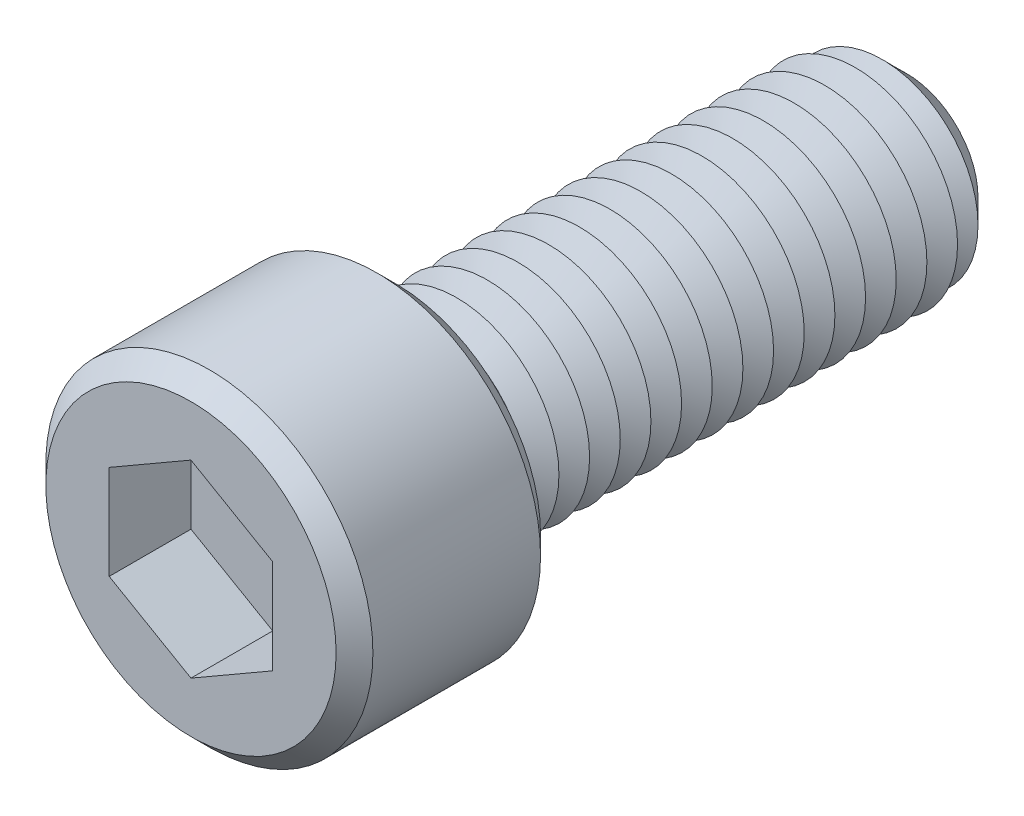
ISO-10303-21;
HEADER;
FILE_DESCRIPTION(('STEP AP214'),'2;1');
FILE_NAME('part.step','',(''),(''),'','','');
FILE_SCHEMA(('AUTOMOTIVE_DESIGN { 1 0 10303 214 1 1 1 1 }'));
ENDSEC;
DATA;
#1=APPLICATION_CONTEXT('core data for automotive mechanical design processes');
#2=APPLICATION_PROTOCOL_DEFINITION('international standard','automotive_design',2000,#1);
#3=PRODUCT_CONTEXT('',#1,'mechanical');
#4=PRODUCT('Part','Part','',(#3));
#5=PRODUCT_RELATED_PRODUCT_CATEGORY('part','',(#4));
#6=PRODUCT_DEFINITION_FORMATION('','',#4);
#7=PRODUCT_DEFINITION_CONTEXT('part definition',#1,'design');
#8=PRODUCT_DEFINITION('design','',#6,#7);
#9=PRODUCT_DEFINITION_SHAPE('','',#8);
#10=(LENGTH_UNIT() NAMED_UNIT(*) SI_UNIT(.MILLI.,.METRE.));
#11=(NAMED_UNIT(*) PLANE_ANGLE_UNIT() SI_UNIT($,.RADIAN.));
#12=(NAMED_UNIT(*) SI_UNIT($,.STERADIAN.) SOLID_ANGLE_UNIT());
#13=UNCERTAINTY_MEASURE_WITH_UNIT(LENGTH_MEASURE(1.E-05),#10,'distance_accuracy_value','');
#14=(GEOMETRIC_REPRESENTATION_CONTEXT(3) GLOBAL_UNCERTAINTY_ASSIGNED_CONTEXT((#13)) GLOBAL_UNIT_ASSIGNED_CONTEXT((#10,
#11,#12)) REPRESENTATION_CONTEXT('',''));
#15=CARTESIAN_POINT('',(0.,0.,0.));
#16=DIRECTION('',(0.,0.,1.));
#17=DIRECTION('',(1.,0.,0.));
#18=AXIS2_PLACEMENT_3D('',#15,#16,#17);
#19=CARTESIAN_POINT('',(0.,0.,10.));
#20=DIRECTION('',(0.,0.,-1.));
#21=DIRECTION('',(-1.,0.,0.));
#22=AXIS2_PLACEMENT_3D('',#19,#20,#21);
#23=CYLINDRICAL_SURFACE('',#22,8.);
#24=CARTESIAN_POINT('',(0.,0.,0.899999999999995));
#25=DIRECTION('',(0.,0.,1.));
#26=DIRECTION('',(1.,0.,0.));
#27=AXIS2_PLACEMENT_3D('',#24,#25,#26);
#28=CIRCLE('',#27,8.);
#29=CARTESIAN_POINT('',(8.,0.,0.899999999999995));
#30=VERTEX_POINT('',#29);
#31=EDGE_CURVE('E305',#30,#30,#28,.T.);
#32=ORIENTED_EDGE('',*,*,#31,.T.);
#33=EDGE_LOOP('',(#32));
#34=FACE_BOUND('',#33,.T.);
#35=CARTESIAN_POINT('',(0.,0.,9.1));
#36=DIRECTION('',(0.,0.,1.));
#37=DIRECTION('',(1.,0.,0.));
#38=AXIS2_PLACEMENT_3D('',#35,#36,#37);
#39=CIRCLE('',#38,8.);
#40=CARTESIAN_POINT('',(8.,0.,9.1));
#41=VERTEX_POINT('',#40);
#42=EDGE_CURVE('E298',#41,#41,#39,.F.);
#43=ORIENTED_EDGE('',*,*,#42,.T.);
#44=EDGE_LOOP('',(#43));
#45=FACE_BOUND('',#44,.T.);
#46=ADVANCED_FACE('F39',(#34,#45),#23,.T.);
#47=CARTESIAN_POINT('',(0.,0.,10.));
#48=DIRECTION('',(0.,0.,1.));
#49=DIRECTION('',(1.,0.,0.));
#50=AXIS2_PLACEMENT_3D('',#47,#48,#49);
#51=PLANE('',#50);
#52=CARTESIAN_POINT('',(0.,0.,10.));
#53=DIRECTION('',(0.,0.,1.));
#54=DIRECTION('',(1.,0.,0.));
#55=AXIS2_PLACEMENT_3D('',#52,#53,#54);
#56=CIRCLE('',#55,7.10000000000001);
#57=CARTESIAN_POINT('',(7.10000000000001,0.,10.));
#58=VERTEX_POINT('',#57);
#59=EDGE_CURVE('E11',#58,#58,#56,.T.);
#60=ORIENTED_EDGE('',*,*,#59,.T.);
#61=EDGE_LOOP('',(#60));
#62=FACE_BOUND('',#61,.T.);
#63=DIRECTION('',(-0.866025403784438,0.5,0.));
#64=VECTOR('',#63,1.);
#65=CARTESIAN_POINT('',(4.,2.3094010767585,10.));
#66=LINE('',#65,#64);
#67=CARTESIAN_POINT('',(4.,2.3094010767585,10.));
#68=VERTEX_POINT('',#67);
#69=CARTESIAN_POINT('',(0.,4.61880215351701,10.));
#70=VERTEX_POINT('',#69);
#71=EDGE_CURVE('E55',#68,#70,#66,.T.);
#72=ORIENTED_EDGE('',*,*,#71,.F.);
#73=DIRECTION('',(0.,1.,0.));
#74=VECTOR('',#73,1.);
#75=CARTESIAN_POINT('',(4.,-2.30940107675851,10.));
#76=LINE('',#75,#74);
#77=CARTESIAN_POINT('',(4.,-2.30940107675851,10.));
#78=VERTEX_POINT('',#77);
#79=EDGE_CURVE('E151',#78,#68,#76,.T.);
#80=ORIENTED_EDGE('',*,*,#79,.F.);
#81=DIRECTION('',(0.866025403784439,0.5,0.));
#82=VECTOR('',#81,1.);
#83=CARTESIAN_POINT('',(0.,-4.61880215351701,10.));
#84=LINE('',#83,#82);
#85=CARTESIAN_POINT('',(0.,-4.61880215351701,10.));
#86=VERTEX_POINT('',#85);
#87=EDGE_CURVE('E148',#86,#78,#84,.T.);
#88=ORIENTED_EDGE('',*,*,#87,.F.);
#89=DIRECTION('',(0.866025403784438,-0.5,0.));
#90=VECTOR('',#89,1.);
#91=CARTESIAN_POINT('',(-4.,-2.3094010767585,10.));
#92=LINE('',#91,#90);
#93=CARTESIAN_POINT('',(-4.,-2.3094010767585,10.));
#94=VERTEX_POINT('',#93);
#95=EDGE_CURVE('E103',#94,#86,#92,.T.);
#96=ORIENTED_EDGE('',*,*,#95,.F.);
#97=DIRECTION('',(0.,-1.,0.));
#98=VECTOR('',#97,1.);
#99=CARTESIAN_POINT('',(-4.,2.3094010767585,10.));
#100=LINE('',#99,#98);
#101=CARTESIAN_POINT('',(-4.,2.3094010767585,10.));
#102=VERTEX_POINT('',#101);
#103=EDGE_CURVE('E142',#102,#94,#100,.T.);
#104=ORIENTED_EDGE('',*,*,#103,.F.);
#105=DIRECTION('',(-0.866025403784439,-0.5,0.));
#106=VECTOR('',#105,1.);
#107=CARTESIAN_POINT('',(0.,4.61880215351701,10.));
#108=LINE('',#107,#106);
#109=EDGE_CURVE('E137',#70,#102,#108,.T.);
#110=ORIENTED_EDGE('',*,*,#109,.F.);
#111=EDGE_LOOP('',(#72,#80,#88,#96,#104,#110));
#112=FACE_BOUND('',#111,.T.);
#113=ADVANCED_FACE('F324',(#62,#112),#51,.T.);
#114=CARTESIAN_POINT('',(0.,0.,0.));
#115=DIRECTION('',(0.,0.,1.));
#116=DIRECTION('',(1.,0.,0.));
#117=AXIS2_PLACEMENT_3D('',#114,#115,#116);
#118=PLANE('',#117);
#119=CARTESIAN_POINT('',(0.,0.,0.));
#120=DIRECTION('',(0.,0.,1.));
#121=DIRECTION('',(1.,0.,0.));
#122=AXIS2_PLACEMENT_3D('',#119,#120,#121);
#123=CIRCLE('',#122,7.1);
#124=CARTESIAN_POINT('',(7.1,0.,0.));
#125=VERTEX_POINT('',#124);
#126=EDGE_CURVE('E48',#125,#125,#123,.F.);
#127=ORIENTED_EDGE('',*,*,#126,.T.);
#128=EDGE_LOOP('',(#127));
#129=FACE_BOUND('',#128,.T.);
#130=CARTESIAN_POINT('',(0.,0.,0.));
#131=DIRECTION('',(0.,0.,1.));
#132=DIRECTION('',(1.,0.,0.));
#133=AXIS2_PLACEMENT_3D('',#130,#131,#132);
#134=CIRCLE('',#133,5.);
#135=CARTESIAN_POINT('',(5.,0.,0.));
#136=VERTEX_POINT('',#135);
#137=EDGE_CURVE('E290',#136,#136,#134,.T.);
#138=ORIENTED_EDGE('',*,*,#137,.T.);
#139=EDGE_LOOP('',(#138));
#140=FACE_BOUND('',#139,.T.);
#141=ADVANCED_FACE('F313',(#129,#140),#118,.F.);
#142=CARTESIAN_POINT('',(0.,0.,0.));
#143=DIRECTION('',(0.,0.,1.));
#144=DIRECTION('',(1.,0.,0.));
#145=AXIS2_PLACEMENT_3D('',#142,#143,#144);
#146=CONICAL_SURFACE('',#145,5.,1.0471975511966);
#147=CARTESIAN_POINT('',(0.,0.,-0.750000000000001));
#148=DIRECTION('',(0.,0.,1.));
#149=DIRECTION('',(1.,0.,0.));
#150=AXIS2_PLACEMENT_3D('',#147,#148,#149);
#151=CIRCLE('',#150,3.70096189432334);
#152=CARTESIAN_POINT('',(3.70096189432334,0.,-0.750000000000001));
#153=VERTEX_POINT('',#152);
#154=EDGE_CURVE('E286',#153,#153,#151,.T.);
#155=ORIENTED_EDGE('',*,*,#154,.T.);
#156=EDGE_LOOP('',(#155));
#157=FACE_BOUND('',#156,.T.);
#158=ORIENTED_EDGE('',*,*,#137,.F.);
#159=EDGE_LOOP('',(#158));
#160=FACE_BOUND('',#159,.T.);
#161=ADVANCED_FACE('F500',(#157,#160),#146,.T.);
#162=CARTESIAN_POINT('',(0.,0.,-0.750000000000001));
#163=DIRECTION('',(0.,0.,-1.));
#164=DIRECTION('',(-1.,0.,0.));
#165=AXIS2_PLACEMENT_3D('',#162,#163,#164);
#166=CONICAL_SURFACE('',#165,3.70096189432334,1.0471975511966);
#167=CARTESIAN_POINT('',(0.,0.,-1.5));
#168=DIRECTION('',(0.,0.,1.));
#169=DIRECTION('',(1.,0.,0.));
#170=AXIS2_PLACEMENT_3D('',#167,#168,#169);
#171=CIRCLE('',#170,5.);
#172=CARTESIAN_POINT('',(5.,0.,-1.5));
#173=VERTEX_POINT('',#172);
#174=EDGE_CURVE('E282',#173,#173,#171,.T.);
#175=ORIENTED_EDGE('',*,*,#174,.T.);
#176=EDGE_LOOP('',(#175));
#177=FACE_BOUND('',#176,.T.);
#178=ORIENTED_EDGE('',*,*,#154,.F.);
#179=EDGE_LOOP('',(#178));
#180=FACE_BOUND('',#179,.T.);
#181=ADVANCED_FACE('F496',(#177,#180),#166,.T.);
#182=CARTESIAN_POINT('',(0.,0.,-1.5));
#183=DIRECTION('',(0.,0.,1.));
#184=DIRECTION('',(1.,0.,0.));
#185=AXIS2_PLACEMENT_3D('',#182,#183,#184);
#186=CONICAL_SURFACE('',#185,5.,1.0471975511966);
#187=CARTESIAN_POINT('',(0.,0.,-2.25));
#188=DIRECTION('',(0.,0.,1.));
#189=DIRECTION('',(1.,0.,0.));
#190=AXIS2_PLACEMENT_3D('',#187,#188,#189);
#191=CIRCLE('',#190,3.70096189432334);
#192=CARTESIAN_POINT('',(3.70096189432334,0.,-2.25));
#193=VERTEX_POINT('',#192);
#194=EDGE_CURVE('E278',#193,#193,#191,.T.);
#195=ORIENTED_EDGE('',*,*,#194,.T.);
#196=EDGE_LOOP('',(#195));
#197=FACE_BOUND('',#196,.T.);
#198=ORIENTED_EDGE('',*,*,#174,.F.);
#199=EDGE_LOOP('',(#198));
#200=FACE_BOUND('',#199,.T.);
#201=ADVANCED_FACE('F492',(#197,#200),#186,.T.);
#202=CARTESIAN_POINT('',(0.,0.,-2.25));
#203=DIRECTION('',(0.,0.,-1.));
#204=DIRECTION('',(-1.,0.,0.));
#205=AXIS2_PLACEMENT_3D('',#202,#203,#204);
#206=CONICAL_SURFACE('',#205,3.70096189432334,1.0471975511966);
#207=CARTESIAN_POINT('',(0.,0.,-3.));
#208=DIRECTION('',(0.,0.,1.));
#209=DIRECTION('',(1.,0.,0.));
#210=AXIS2_PLACEMENT_3D('',#207,#208,#209);
#211=CIRCLE('',#210,5.);
#212=CARTESIAN_POINT('',(5.,0.,-3.));
#213=VERTEX_POINT('',#212);
#214=EDGE_CURVE('E274',#213,#213,#211,.T.);
#215=ORIENTED_EDGE('',*,*,#214,.T.);
#216=EDGE_LOOP('',(#215));
#217=FACE_BOUND('',#216,.T.);
#218=ORIENTED_EDGE('',*,*,#194,.F.);
#219=EDGE_LOOP('',(#218));
#220=FACE_BOUND('',#219,.T.);
#221=ADVANCED_FACE('F488',(#217,#220),#206,.T.);
#222=CARTESIAN_POINT('',(0.,0.,-3.));
#223=DIRECTION('',(0.,0.,1.));
#224=DIRECTION('',(1.,0.,0.));
#225=AXIS2_PLACEMENT_3D('',#222,#223,#224);
#226=CONICAL_SURFACE('',#225,5.,1.0471975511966);
#227=CARTESIAN_POINT('',(0.,0.,-3.75));
#228=DIRECTION('',(0.,0.,1.));
#229=DIRECTION('',(1.,0.,0.));
#230=AXIS2_PLACEMENT_3D('',#227,#228,#229);
#231=CIRCLE('',#230,3.70096189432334);
#232=CARTESIAN_POINT('',(3.70096189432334,0.,-3.75));
#233=VERTEX_POINT('',#232);
#234=EDGE_CURVE('E270',#233,#233,#231,.T.);
#235=ORIENTED_EDGE('',*,*,#234,.T.);
#236=EDGE_LOOP('',(#235));
#237=FACE_BOUND('',#236,.T.);
#238=ORIENTED_EDGE('',*,*,#214,.F.);
#239=EDGE_LOOP('',(#238));
#240=FACE_BOUND('',#239,.T.);
#241=ADVANCED_FACE('F484',(#237,#240),#226,.T.);
#242=CARTESIAN_POINT('',(0.,0.,-3.75));
#243=DIRECTION('',(0.,0.,-1.));
#244=DIRECTION('',(-1.,0.,0.));
#245=AXIS2_PLACEMENT_3D('',#242,#243,#244);
#246=CONICAL_SURFACE('',#245,3.70096189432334,1.0471975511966);
#247=CARTESIAN_POINT('',(0.,0.,-4.5));
#248=DIRECTION('',(0.,0.,1.));
#249=DIRECTION('',(1.,0.,0.));
#250=AXIS2_PLACEMENT_3D('',#247,#248,#249);
#251=CIRCLE('',#250,5.);
#252=CARTESIAN_POINT('',(5.,0.,-4.5));
#253=VERTEX_POINT('',#252);
#254=EDGE_CURVE('E266',#253,#253,#251,.T.);
#255=ORIENTED_EDGE('',*,*,#254,.T.);
#256=EDGE_LOOP('',(#255));
#257=FACE_BOUND('',#256,.T.);
#258=ORIENTED_EDGE('',*,*,#234,.F.);
#259=EDGE_LOOP('',(#258));
#260=FACE_BOUND('',#259,.T.);
#261=ADVANCED_FACE('F480',(#257,#260),#246,.T.);
#262=CARTESIAN_POINT('',(0.,0.,-4.5));
#263=DIRECTION('',(0.,0.,1.));
#264=DIRECTION('',(1.,0.,0.));
#265=AXIS2_PLACEMENT_3D('',#262,#263,#264);
#266=CONICAL_SURFACE('',#265,5.,1.0471975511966);
#267=CARTESIAN_POINT('',(0.,0.,-5.25));
#268=DIRECTION('',(0.,0.,1.));
#269=DIRECTION('',(1.,0.,0.));
#270=AXIS2_PLACEMENT_3D('',#267,#268,#269);
#271=CIRCLE('',#270,3.70096189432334);
#272=CARTESIAN_POINT('',(3.70096189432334,0.,-5.25));
#273=VERTEX_POINT('',#272);
#274=EDGE_CURVE('E262',#273,#273,#271,.T.);
#275=ORIENTED_EDGE('',*,*,#274,.T.);
#276=EDGE_LOOP('',(#275));
#277=FACE_BOUND('',#276,.T.);
#278=ORIENTED_EDGE('',*,*,#254,.F.);
#279=EDGE_LOOP('',(#278));
#280=FACE_BOUND('',#279,.T.);
#281=ADVANCED_FACE('F476',(#277,#280),#266,.T.);
#282=CARTESIAN_POINT('',(0.,0.,-5.25));
#283=DIRECTION('',(0.,0.,-1.));
#284=DIRECTION('',(-1.,0.,0.));
#285=AXIS2_PLACEMENT_3D('',#282,#283,#284);
#286=CONICAL_SURFACE('',#285,3.70096189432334,1.0471975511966);
#287=CARTESIAN_POINT('',(0.,0.,-6.));
#288=DIRECTION('',(0.,0.,1.));
#289=DIRECTION('',(1.,0.,0.));
#290=AXIS2_PLACEMENT_3D('',#287,#288,#289);
#291=CIRCLE('',#290,5.);
#292=CARTESIAN_POINT('',(5.,0.,-6.));
#293=VERTEX_POINT('',#292);
#294=EDGE_CURVE('E258',#293,#293,#291,.T.);
#295=ORIENTED_EDGE('',*,*,#294,.T.);
#296=EDGE_LOOP('',(#295));
#297=FACE_BOUND('',#296,.T.);
#298=ORIENTED_EDGE('',*,*,#274,.F.);
#299=EDGE_LOOP('',(#298));
#300=FACE_BOUND('',#299,.T.);
#301=ADVANCED_FACE('F472',(#297,#300),#286,.T.);
#302=CARTESIAN_POINT('',(0.,0.,-6.));
#303=DIRECTION('',(0.,0.,1.));
#304=DIRECTION('',(1.,0.,0.));
#305=AXIS2_PLACEMENT_3D('',#302,#303,#304);
#306=CONICAL_SURFACE('',#305,5.,1.0471975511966);
#307=CARTESIAN_POINT('',(0.,0.,-6.75));
#308=DIRECTION('',(0.,0.,1.));
#309=DIRECTION('',(1.,0.,0.));
#310=AXIS2_PLACEMENT_3D('',#307,#308,#309);
#311=CIRCLE('',#310,3.70096189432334);
#312=CARTESIAN_POINT('',(3.70096189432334,0.,-6.75));
#313=VERTEX_POINT('',#312);
#314=EDGE_CURVE('E254',#313,#313,#311,.T.);
#315=ORIENTED_EDGE('',*,*,#314,.T.);
#316=EDGE_LOOP('',(#315));
#317=FACE_BOUND('',#316,.T.);
#318=ORIENTED_EDGE('',*,*,#294,.F.);
#319=EDGE_LOOP('',(#318));
#320=FACE_BOUND('',#319,.T.);
#321=ADVANCED_FACE('F468',(#317,#320),#306,.T.);
#322=CARTESIAN_POINT('',(0.,0.,-6.75));
#323=DIRECTION('',(0.,0.,-1.));
#324=DIRECTION('',(-1.,0.,0.));
#325=AXIS2_PLACEMENT_3D('',#322,#323,#324);
#326=CONICAL_SURFACE('',#325,3.70096189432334,1.0471975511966);
#327=CARTESIAN_POINT('',(0.,0.,-7.5));
#328=DIRECTION('',(0.,0.,1.));
#329=DIRECTION('',(1.,0.,0.));
#330=AXIS2_PLACEMENT_3D('',#327,#328,#329);
#331=CIRCLE('',#330,5.);
#332=CARTESIAN_POINT('',(5.,0.,-7.5));
#333=VERTEX_POINT('',#332);
#334=EDGE_CURVE('E250',#333,#333,#331,.T.);
#335=ORIENTED_EDGE('',*,*,#334,.T.);
#336=EDGE_LOOP('',(#335));
#337=FACE_BOUND('',#336,.T.);
#338=ORIENTED_EDGE('',*,*,#314,.F.);
#339=EDGE_LOOP('',(#338));
#340=FACE_BOUND('',#339,.T.);
#341=ADVANCED_FACE('F464',(#337,#340),#326,.T.);
#342=CARTESIAN_POINT('',(0.,0.,-7.5));
#343=DIRECTION('',(0.,0.,1.));
#344=DIRECTION('',(1.,0.,0.));
#345=AXIS2_PLACEMENT_3D('',#342,#343,#344);
#346=CONICAL_SURFACE('',#345,5.,1.0471975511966);
#347=CARTESIAN_POINT('',(0.,0.,-8.25));
#348=DIRECTION('',(0.,0.,1.));
#349=DIRECTION('',(1.,0.,0.));
#350=AXIS2_PLACEMENT_3D('',#347,#348,#349);
#351=CIRCLE('',#350,3.70096189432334);
#352=CARTESIAN_POINT('',(3.70096189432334,0.,-8.25));
#353=VERTEX_POINT('',#352);
#354=EDGE_CURVE('E246',#353,#353,#351,.T.);
#355=ORIENTED_EDGE('',*,*,#354,.T.);
#356=EDGE_LOOP('',(#355));
#357=FACE_BOUND('',#356,.T.);
#358=ORIENTED_EDGE('',*,*,#334,.F.);
#359=EDGE_LOOP('',(#358));
#360=FACE_BOUND('',#359,.T.);
#361=ADVANCED_FACE('F460',(#357,#360),#346,.T.);
#362=CARTESIAN_POINT('',(0.,0.,-8.25));
#363=DIRECTION('',(0.,0.,-1.));
#364=DIRECTION('',(-1.,0.,0.));
#365=AXIS2_PLACEMENT_3D('',#362,#363,#364);
#366=CONICAL_SURFACE('',#365,3.70096189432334,1.0471975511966);
#367=CARTESIAN_POINT('',(0.,0.,-9.));
#368=DIRECTION('',(0.,0.,1.));
#369=DIRECTION('',(1.,0.,0.));
#370=AXIS2_PLACEMENT_3D('',#367,#368,#369);
#371=CIRCLE('',#370,5.);
#372=CARTESIAN_POINT('',(5.,0.,-9.));
#373=VERTEX_POINT('',#372);
#374=EDGE_CURVE('E242',#373,#373,#371,.T.);
#375=ORIENTED_EDGE('',*,*,#374,.T.);
#376=EDGE_LOOP('',(#375));
#377=FACE_BOUND('',#376,.T.);
#378=ORIENTED_EDGE('',*,*,#354,.F.);
#379=EDGE_LOOP('',(#378));
#380=FACE_BOUND('',#379,.T.);
#381=ADVANCED_FACE('F456',(#377,#380),#366,.T.);
#382=CARTESIAN_POINT('',(0.,0.,-9.));
#383=DIRECTION('',(0.,0.,1.));
#384=DIRECTION('',(1.,0.,0.));
#385=AXIS2_PLACEMENT_3D('',#382,#383,#384);
#386=CONICAL_SURFACE('',#385,5.,1.0471975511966);
#387=CARTESIAN_POINT('',(0.,0.,-9.75));
#388=DIRECTION('',(0.,0.,1.));
#389=DIRECTION('',(1.,0.,0.));
#390=AXIS2_PLACEMENT_3D('',#387,#388,#389);
#391=CIRCLE('',#390,3.70096189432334);
#392=CARTESIAN_POINT('',(3.70096189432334,0.,-9.75));
#393=VERTEX_POINT('',#392);
#394=EDGE_CURVE('E238',#393,#393,#391,.T.);
#395=ORIENTED_EDGE('',*,*,#394,.T.);
#396=EDGE_LOOP('',(#395));
#397=FACE_BOUND('',#396,.T.);
#398=ORIENTED_EDGE('',*,*,#374,.F.);
#399=EDGE_LOOP('',(#398));
#400=FACE_BOUND('',#399,.T.);
#401=ADVANCED_FACE('F452',(#397,#400),#386,.T.);
#402=CARTESIAN_POINT('',(0.,0.,-9.75));
#403=DIRECTION('',(0.,0.,-1.));
#404=DIRECTION('',(-1.,0.,0.));
#405=AXIS2_PLACEMENT_3D('',#402,#403,#404);
#406=CONICAL_SURFACE('',#405,3.70096189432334,1.0471975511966);
#407=CARTESIAN_POINT('',(0.,0.,-10.5));
#408=DIRECTION('',(0.,0.,1.));
#409=DIRECTION('',(1.,0.,0.));
#410=AXIS2_PLACEMENT_3D('',#407,#408,#409);
#411=CIRCLE('',#410,5.);
#412=CARTESIAN_POINT('',(5.,0.,-10.5));
#413=VERTEX_POINT('',#412);
#414=EDGE_CURVE('E234',#413,#413,#411,.T.);
#415=ORIENTED_EDGE('',*,*,#414,.T.);
#416=EDGE_LOOP('',(#415));
#417=FACE_BOUND('',#416,.T.);
#418=ORIENTED_EDGE('',*,*,#394,.F.);
#419=EDGE_LOOP('',(#418));
#420=FACE_BOUND('',#419,.T.);
#421=ADVANCED_FACE('F448',(#417,#420),#406,.T.);
#422=CARTESIAN_POINT('',(0.,0.,-10.5));
#423=DIRECTION('',(0.,0.,1.));
#424=DIRECTION('',(1.,0.,0.));
#425=AXIS2_PLACEMENT_3D('',#422,#423,#424);
#426=CONICAL_SURFACE('',#425,5.,1.0471975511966);
#427=CARTESIAN_POINT('',(0.,0.,-11.25));
#428=DIRECTION('',(0.,0.,1.));
#429=DIRECTION('',(1.,0.,0.));
#430=AXIS2_PLACEMENT_3D('',#427,#428,#429);
#431=CIRCLE('',#430,3.70096189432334);
#432=CARTESIAN_POINT('',(3.70096189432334,0.,-11.25));
#433=VERTEX_POINT('',#432);
#434=EDGE_CURVE('E230',#433,#433,#431,.T.);
#435=ORIENTED_EDGE('',*,*,#434,.T.);
#436=EDGE_LOOP('',(#435));
#437=FACE_BOUND('',#436,.T.);
#438=ORIENTED_EDGE('',*,*,#414,.F.);
#439=EDGE_LOOP('',(#438));
#440=FACE_BOUND('',#439,.T.);
#441=ADVANCED_FACE('F444',(#437,#440),#426,.T.);
#442=CARTESIAN_POINT('',(0.,0.,-11.25));
#443=DIRECTION('',(0.,0.,-1.));
#444=DIRECTION('',(-1.,0.,0.));
#445=AXIS2_PLACEMENT_3D('',#442,#443,#444);
#446=CONICAL_SURFACE('',#445,3.70096189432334,1.0471975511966);
#447=CARTESIAN_POINT('',(0.,0.,-12.));
#448=DIRECTION('',(0.,0.,1.));
#449=DIRECTION('',(1.,0.,0.));
#450=AXIS2_PLACEMENT_3D('',#447,#448,#449);
#451=CIRCLE('',#450,5.);
#452=CARTESIAN_POINT('',(5.,0.,-12.));
#453=VERTEX_POINT('',#452);
#454=EDGE_CURVE('E226',#453,#453,#451,.T.);
#455=ORIENTED_EDGE('',*,*,#454,.T.);
#456=EDGE_LOOP('',(#455));
#457=FACE_BOUND('',#456,.T.);
#458=ORIENTED_EDGE('',*,*,#434,.F.);
#459=EDGE_LOOP('',(#458));
#460=FACE_BOUND('',#459,.T.);
#461=ADVANCED_FACE('F440',(#457,#460),#446,.T.);
#462=CARTESIAN_POINT('',(0.,0.,-12.));
#463=DIRECTION('',(0.,0.,1.));
#464=DIRECTION('',(1.,0.,0.));
#465=AXIS2_PLACEMENT_3D('',#462,#463,#464);
#466=CONICAL_SURFACE('',#465,5.,1.0471975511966);
#467=CARTESIAN_POINT('',(0.,0.,-12.75));
#468=DIRECTION('',(0.,0.,1.));
#469=DIRECTION('',(1.,0.,0.));
#470=AXIS2_PLACEMENT_3D('',#467,#468,#469);
#471=CIRCLE('',#470,3.70096189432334);
#472=CARTESIAN_POINT('',(3.70096189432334,0.,-12.75));
#473=VERTEX_POINT('',#472);
#474=EDGE_CURVE('E222',#473,#473,#471,.T.);
#475=ORIENTED_EDGE('',*,*,#474,.T.);
#476=EDGE_LOOP('',(#475));
#477=FACE_BOUND('',#476,.T.);
#478=ORIENTED_EDGE('',*,*,#454,.F.);
#479=EDGE_LOOP('',(#478));
#480=FACE_BOUND('',#479,.T.);
#481=ADVANCED_FACE('F436',(#477,#480),#466,.T.);
#482=CARTESIAN_POINT('',(0.,0.,-12.75));
#483=DIRECTION('',(0.,0.,-1.));
#484=DIRECTION('',(-1.,0.,0.));
#485=AXIS2_PLACEMENT_3D('',#482,#483,#484);
#486=CONICAL_SURFACE('',#485,3.70096189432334,1.0471975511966);
#487=CARTESIAN_POINT('',(0.,0.,-13.5));
#488=DIRECTION('',(0.,0.,1.));
#489=DIRECTION('',(1.,0.,0.));
#490=AXIS2_PLACEMENT_3D('',#487,#488,#489);
#491=CIRCLE('',#490,5.);
#492=CARTESIAN_POINT('',(5.,0.,-13.5));
#493=VERTEX_POINT('',#492);
#494=EDGE_CURVE('E218',#493,#493,#491,.T.);
#495=ORIENTED_EDGE('',*,*,#494,.T.);
#496=EDGE_LOOP('',(#495));
#497=FACE_BOUND('',#496,.T.);
#498=ORIENTED_EDGE('',*,*,#474,.F.);
#499=EDGE_LOOP('',(#498));
#500=FACE_BOUND('',#499,.T.);
#501=ADVANCED_FACE('F432',(#497,#500),#486,.T.);
#502=CARTESIAN_POINT('',(0.,0.,-13.5));
#503=DIRECTION('',(0.,0.,1.));
#504=DIRECTION('',(1.,0.,0.));
#505=AXIS2_PLACEMENT_3D('',#502,#503,#504);
#506=CONICAL_SURFACE('',#505,5.,1.0471975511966);
#507=CARTESIAN_POINT('',(0.,0.,-14.25));
#508=DIRECTION('',(0.,0.,1.));
#509=DIRECTION('',(1.,0.,0.));
#510=AXIS2_PLACEMENT_3D('',#507,#508,#509);
#511=CIRCLE('',#510,3.70096189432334);
#512=CARTESIAN_POINT('',(3.70096189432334,0.,-14.25));
#513=VERTEX_POINT('',#512);
#514=EDGE_CURVE('E214',#513,#513,#511,.T.);
#515=ORIENTED_EDGE('',*,*,#514,.T.);
#516=EDGE_LOOP('',(#515));
#517=FACE_BOUND('',#516,.T.);
#518=ORIENTED_EDGE('',*,*,#494,.F.);
#519=EDGE_LOOP('',(#518));
#520=FACE_BOUND('',#519,.T.);
#521=ADVANCED_FACE('F428',(#517,#520),#506,.T.);
#522=CARTESIAN_POINT('',(0.,0.,-14.25));
#523=DIRECTION('',(0.,0.,-1.));
#524=DIRECTION('',(-1.,0.,0.));
#525=AXIS2_PLACEMENT_3D('',#522,#523,#524);
#526=CONICAL_SURFACE('',#525,3.70096189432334,1.0471975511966);
#527=CARTESIAN_POINT('',(0.,0.,-15.));
#528=DIRECTION('',(0.,0.,1.));
#529=DIRECTION('',(1.,0.,0.));
#530=AXIS2_PLACEMENT_3D('',#527,#528,#529);
#531=CIRCLE('',#530,5.);
#532=CARTESIAN_POINT('',(5.,0.,-15.));
#533=VERTEX_POINT('',#532);
#534=EDGE_CURVE('E211',#533,#533,#531,.T.);
#535=ORIENTED_EDGE('',*,*,#534,.T.);
#536=EDGE_LOOP('',(#535));
#537=FACE_BOUND('',#536,.T.);
#538=ORIENTED_EDGE('',*,*,#514,.F.);
#539=EDGE_LOOP('',(#538));
#540=FACE_BOUND('',#539,.T.);
#541=ADVANCED_FACE('F424',(#537,#540),#526,.T.);
#542=CARTESIAN_POINT('',(0.,0.,-15.));
#543=DIRECTION('',(0.,0.,1.));
#544=DIRECTION('',(1.,0.,0.));
#545=AXIS2_PLACEMENT_3D('',#542,#543,#544);
#546=CONICAL_SURFACE('',#545,5.,1.0471975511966);
#547=CARTESIAN_POINT('',(0.,0.,-15.75));
#548=DIRECTION('',(0.,0.,1.));
#549=DIRECTION('',(1.,0.,0.));
#550=AXIS2_PLACEMENT_3D('',#547,#548,#549);
#551=CIRCLE('',#550,3.70096189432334);
#552=CARTESIAN_POINT('',(3.70096189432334,0.,-15.75));
#553=VERTEX_POINT('',#552);
#554=EDGE_CURVE('E207',#553,#553,#551,.T.);
#555=ORIENTED_EDGE('',*,*,#554,.T.);
#556=EDGE_LOOP('',(#555));
#557=FACE_BOUND('',#556,.T.);
#558=ORIENTED_EDGE('',*,*,#534,.F.);
#559=EDGE_LOOP('',(#558));
#560=FACE_BOUND('',#559,.T.);
#561=ADVANCED_FACE('F420',(#557,#560),#546,.T.);
#562=CARTESIAN_POINT('',(0.,0.,-15.75));
#563=DIRECTION('',(0.,0.,-1.));
#564=DIRECTION('',(-1.,0.,0.));
#565=AXIS2_PLACEMENT_3D('',#562,#563,#564);
#566=CONICAL_SURFACE('',#565,3.70096189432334,1.0471975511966);
#567=CARTESIAN_POINT('',(0.,0.,-16.5));
#568=DIRECTION('',(0.,0.,1.));
#569=DIRECTION('',(1.,0.,0.));
#570=AXIS2_PLACEMENT_3D('',#567,#568,#569);
#571=CIRCLE('',#570,5.);
#572=CARTESIAN_POINT('',(5.,0.,-16.5));
#573=VERTEX_POINT('',#572);
#574=EDGE_CURVE('E203',#573,#573,#571,.T.);
#575=ORIENTED_EDGE('',*,*,#574,.T.);
#576=EDGE_LOOP('',(#575));
#577=FACE_BOUND('',#576,.T.);
#578=ORIENTED_EDGE('',*,*,#554,.F.);
#579=EDGE_LOOP('',(#578));
#580=FACE_BOUND('',#579,.T.);
#581=ADVANCED_FACE('F416',(#577,#580),#566,.T.);
#582=CARTESIAN_POINT('',(0.,0.,-16.5));
#583=DIRECTION('',(0.,0.,1.));
#584=DIRECTION('',(1.,0.,0.));
#585=AXIS2_PLACEMENT_3D('',#582,#583,#584);
#586=CONICAL_SURFACE('',#585,5.,1.0471975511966);
#587=CARTESIAN_POINT('',(0.,0.,-17.25));
#588=DIRECTION('',(0.,0.,1.));
#589=DIRECTION('',(1.,0.,0.));
#590=AXIS2_PLACEMENT_3D('',#587,#588,#589);
#591=CIRCLE('',#590,3.70096189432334);
#592=CARTESIAN_POINT('',(3.70096189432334,0.,-17.25));
#593=VERTEX_POINT('',#592);
#594=EDGE_CURVE('E199',#593,#593,#591,.T.);
#595=ORIENTED_EDGE('',*,*,#594,.T.);
#596=EDGE_LOOP('',(#595));
#597=FACE_BOUND('',#596,.T.);
#598=ORIENTED_EDGE('',*,*,#574,.F.);
#599=EDGE_LOOP('',(#598));
#600=FACE_BOUND('',#599,.T.);
#601=ADVANCED_FACE('F412',(#597,#600),#586,.T.);
#602=CARTESIAN_POINT('',(0.,0.,-17.25));
#603=DIRECTION('',(0.,0.,-1.));
#604=DIRECTION('',(-1.,0.,0.));
#605=AXIS2_PLACEMENT_3D('',#602,#603,#604);
#606=CONICAL_SURFACE('',#605,3.70096189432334,1.0471975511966);
#607=CARTESIAN_POINT('',(0.,0.,-18.));
#608=DIRECTION('',(0.,0.,1.));
#609=DIRECTION('',(1.,0.,0.));
#610=AXIS2_PLACEMENT_3D('',#607,#608,#609);
#611=CIRCLE('',#610,5.);
#612=CARTESIAN_POINT('',(5.,0.,-18.));
#613=VERTEX_POINT('',#612);
#614=EDGE_CURVE('E195',#613,#613,#611,.T.);
#615=ORIENTED_EDGE('',*,*,#614,.T.);
#616=EDGE_LOOP('',(#615));
#617=FACE_BOUND('',#616,.T.);
#618=ORIENTED_EDGE('',*,*,#594,.F.);
#619=EDGE_LOOP('',(#618));
#620=FACE_BOUND('',#619,.T.);
#621=ADVANCED_FACE('F408',(#617,#620),#606,.T.);
#622=CARTESIAN_POINT('',(0.,0.,-18.));
#623=DIRECTION('',(0.,0.,1.));
#624=DIRECTION('',(1.,0.,0.));
#625=AXIS2_PLACEMENT_3D('',#622,#623,#624);
#626=CONICAL_SURFACE('',#625,5.,1.0471975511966);
#627=CARTESIAN_POINT('',(0.,0.,-18.75));
#628=DIRECTION('',(0.,0.,1.));
#629=DIRECTION('',(1.,0.,0.));
#630=AXIS2_PLACEMENT_3D('',#627,#628,#629);
#631=CIRCLE('',#630,3.70096189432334);
#632=CARTESIAN_POINT('',(3.70096189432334,0.,-18.75));
#633=VERTEX_POINT('',#632);
#634=EDGE_CURVE('E191',#633,#633,#631,.T.);
#635=ORIENTED_EDGE('',*,*,#634,.T.);
#636=EDGE_LOOP('',(#635));
#637=FACE_BOUND('',#636,.T.);
#638=ORIENTED_EDGE('',*,*,#614,.F.);
#639=EDGE_LOOP('',(#638));
#640=FACE_BOUND('',#639,.T.);
#641=ADVANCED_FACE('F404',(#637,#640),#626,.T.);
#642=CARTESIAN_POINT('',(0.,0.,-18.75));
#643=DIRECTION('',(0.,0.,-1.));
#644=DIRECTION('',(-1.,0.,0.));
#645=AXIS2_PLACEMENT_3D('',#642,#643,#644);
#646=CONICAL_SURFACE('',#645,3.70096189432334,1.0471975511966);
#647=CARTESIAN_POINT('',(0.,0.,-19.5));
#648=DIRECTION('',(0.,0.,1.));
#649=DIRECTION('',(1.,0.,0.));
#650=AXIS2_PLACEMENT_3D('',#647,#648,#649);
#651=CIRCLE('',#650,5.);
#652=CARTESIAN_POINT('',(5.,0.,-19.5));
#653=VERTEX_POINT('',#652);
#654=EDGE_CURVE('E187',#653,#653,#651,.T.);
#655=ORIENTED_EDGE('',*,*,#654,.T.);
#656=EDGE_LOOP('',(#655));
#657=FACE_BOUND('',#656,.T.);
#658=ORIENTED_EDGE('',*,*,#634,.F.);
#659=EDGE_LOOP('',(#658));
#660=FACE_BOUND('',#659,.T.);
#661=ADVANCED_FACE('F400',(#657,#660),#646,.T.);
#662=CARTESIAN_POINT('',(0.,0.,-19.5));
#663=DIRECTION('',(0.,0.,1.));
#664=DIRECTION('',(1.,0.,0.));
#665=AXIS2_PLACEMENT_3D('',#662,#663,#664);
#666=CONICAL_SURFACE('',#665,5.,1.0471975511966);
#667=CARTESIAN_POINT('',(0.,0.,-20.25));
#668=DIRECTION('',(0.,0.,1.));
#669=DIRECTION('',(1.,0.,0.));
#670=AXIS2_PLACEMENT_3D('',#667,#668,#669);
#671=CIRCLE('',#670,3.70096189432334);
#672=CARTESIAN_POINT('',(3.70096189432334,0.,-20.25));
#673=VERTEX_POINT('',#672);
#674=EDGE_CURVE('E183',#673,#673,#671,.T.);
#675=ORIENTED_EDGE('',*,*,#674,.T.);
#676=EDGE_LOOP('',(#675));
#677=FACE_BOUND('',#676,.T.);
#678=ORIENTED_EDGE('',*,*,#654,.F.);
#679=EDGE_LOOP('',(#678));
#680=FACE_BOUND('',#679,.T.);
#681=ADVANCED_FACE('F396',(#677,#680),#666,.T.);
#682=CARTESIAN_POINT('',(0.,0.,-20.25));
#683=DIRECTION('',(0.,0.,-1.));
#684=DIRECTION('',(-1.,0.,0.));
#685=AXIS2_PLACEMENT_3D('',#682,#683,#684);
#686=CONICAL_SURFACE('',#685,3.70096189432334,1.0471975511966);
#687=CARTESIAN_POINT('',(0.,0.,-21.));
#688=DIRECTION('',(0.,0.,1.));
#689=DIRECTION('',(1.,0.,0.));
#690=AXIS2_PLACEMENT_3D('',#687,#688,#689);
#691=CIRCLE('',#690,5.);
#692=CARTESIAN_POINT('',(5.,0.,-21.));
#693=VERTEX_POINT('',#692);
#694=EDGE_CURVE('E179',#693,#693,#691,.T.);
#695=ORIENTED_EDGE('',*,*,#694,.T.);
#696=EDGE_LOOP('',(#695));
#697=FACE_BOUND('',#696,.T.);
#698=ORIENTED_EDGE('',*,*,#674,.F.);
#699=EDGE_LOOP('',(#698));
#700=FACE_BOUND('',#699,.T.);
#701=ADVANCED_FACE('F392',(#697,#700),#686,.T.);
#702=CARTESIAN_POINT('',(0.,0.,-21.));
#703=DIRECTION('',(0.,0.,1.));
#704=DIRECTION('',(1.,0.,0.));
#705=AXIS2_PLACEMENT_3D('',#702,#703,#704);
#706=CONICAL_SURFACE('',#705,5.,1.0471975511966);
#707=CARTESIAN_POINT('',(0.,0.,-21.75));
#708=DIRECTION('',(0.,0.,1.));
#709=DIRECTION('',(1.,0.,0.));
#710=AXIS2_PLACEMENT_3D('',#707,#708,#709);
#711=CIRCLE('',#710,3.70096189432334);
#712=CARTESIAN_POINT('',(3.70096189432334,0.,-21.75));
#713=VERTEX_POINT('',#712);
#714=EDGE_CURVE('E175',#713,#713,#711,.T.);
#715=ORIENTED_EDGE('',*,*,#714,.T.);
#716=EDGE_LOOP('',(#715));
#717=FACE_BOUND('',#716,.T.);
#718=ORIENTED_EDGE('',*,*,#694,.F.);
#719=EDGE_LOOP('',(#718));
#720=FACE_BOUND('',#719,.T.);
#721=ADVANCED_FACE('F388',(#717,#720),#706,.T.);
#722=CARTESIAN_POINT('',(0.,0.,-21.75));
#723=DIRECTION('',(0.,0.,-1.));
#724=DIRECTION('',(-1.,0.,0.));
#725=AXIS2_PLACEMENT_3D('',#722,#723,#724);
#726=CONICAL_SURFACE('',#725,3.70096189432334,1.0471975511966);
#727=CARTESIAN_POINT('',(0.,0.,-22.5));
#728=DIRECTION('',(0.,0.,1.));
#729=DIRECTION('',(1.,0.,0.));
#730=AXIS2_PLACEMENT_3D('',#727,#728,#729);
#731=CIRCLE('',#730,5.);
#732=CARTESIAN_POINT('',(5.,0.,-22.5));
#733=VERTEX_POINT('',#732);
#734=EDGE_CURVE('E170',#733,#733,#731,.T.);
#735=ORIENTED_EDGE('',*,*,#734,.T.);
#736=EDGE_LOOP('',(#735));
#737=FACE_BOUND('',#736,.T.);
#738=ORIENTED_EDGE('',*,*,#714,.F.);
#739=EDGE_LOOP('',(#738));
#740=FACE_BOUND('',#739,.T.);
#741=ADVANCED_FACE('F384',(#737,#740),#726,.T.);
#742=CARTESIAN_POINT('',(0.,0.,-22.5));
#743=DIRECTION('',(0.,0.,1.));
#744=DIRECTION('',(1.,0.,0.));
#745=AXIS2_PLACEMENT_3D('',#742,#743,#744);
#746=CONICAL_SURFACE('',#745,5.,1.0471975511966);
#747=CARTESIAN_POINT('',(0.,0.,-23.25));
#748=DIRECTION('',(0.,0.,1.));
#749=DIRECTION('',(1.,0.,0.));
#750=AXIS2_PLACEMENT_3D('',#747,#748,#749);
#751=CIRCLE('',#750,3.70096189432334);
#752=CARTESIAN_POINT('',(3.70096189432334,0.,-23.25));
#753=VERTEX_POINT('',#752);
#754=EDGE_CURVE('E157',#753,#753,#751,.T.);
#755=ORIENTED_EDGE('',*,*,#754,.T.);
#756=EDGE_LOOP('',(#755));
#757=FACE_BOUND('',#756,.T.);
#758=ORIENTED_EDGE('',*,*,#734,.F.);
#759=EDGE_LOOP('',(#758));
#760=FACE_BOUND('',#759,.T.);
#761=ADVANCED_FACE('F380',(#757,#760),#746,.T.);
#762=CARTESIAN_POINT('',(0.,0.,-23.25));
#763=DIRECTION('',(0.,0.,-1.));
#764=DIRECTION('',(-1.,0.,0.));
#765=AXIS2_PLACEMENT_3D('',#762,#763,#764);
#766=CONICAL_SURFACE('',#765,3.70096189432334,1.0471975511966);
#767=CARTESIAN_POINT('',(0.,0.,-23.8169872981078));
#768=DIRECTION('',(0.,0.,-1.));
#769=DIRECTION('',(-1.,0.,0.));
#770=AXIS2_PLACEMENT_3D('',#767,#768,#769);
#771=CIRCLE('',#770,4.68301270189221);
#772=CARTESIAN_POINT('',(4.68301270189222,0.,-23.8169872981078));
#773=VERTEX_POINT('',#772);
#774=EDGE_CURVE('E174',#773,#773,#771,.T.);
#775=ORIENTED_EDGE('',*,*,#774,.F.);
#776=EDGE_LOOP('',(#775));
#777=FACE_BOUND('',#776,.T.);
#778=ORIENTED_EDGE('',*,*,#754,.F.);
#779=EDGE_LOOP('',(#778));
#780=FACE_BOUND('',#779,.T.);
#781=ADVANCED_FACE('F376',(#777,#780),#766,.T.);
#782=CARTESIAN_POINT('',(0.,0.,-25.));
#783=DIRECTION('',(0.,0.,-1.));
#784=DIRECTION('',(-1.,0.,0.));
#785=AXIS2_PLACEMENT_3D('',#782,#783,#784);
#786=PLANE('',#785);
#787=CARTESIAN_POINT('',(0.,0.,-25.));
#788=DIRECTION('',(0.,0.,-1.));
#789=DIRECTION('',(-1.,0.,0.));
#790=AXIS2_PLACEMENT_3D('',#787,#788,#789);
#791=CIRCLE('',#790,0.9);
#792=CARTESIAN_POINT('',(-0.9,0.,-25.));
#793=VERTEX_POINT('',#792);
#794=EDGE_CURVE('E138',#793,#793,#791,.F.);
#795=ORIENTED_EDGE('',*,*,#794,.T.);
#796=EDGE_LOOP('',(#795));
#797=FACE_BOUND('',#796,.T.);
#798=CARTESIAN_POINT('',(0.,0.,-25.));
#799=DIRECTION('',(0.,0.,-1.));
#800=DIRECTION('',(-1.,0.,0.));
#801=AXIS2_PLACEMENT_3D('',#798,#799,#800);
#802=CIRCLE('',#801,3.5);
#803=CARTESIAN_POINT('',(3.5,0.,-25.));
#804=VERTEX_POINT('',#803);
#805=EDGE_CURVE('E294',#804,#804,#802,.T.);
#806=ORIENTED_EDGE('',*,*,#805,.T.);
#807=EDGE_LOOP('',(#806));
#808=FACE_BOUND('',#807,.T.);
#809=ADVANCED_FACE('F379',(#797,#808),#786,.T.);
#810=CARTESIAN_POINT('',(0.,0.,-25.));
#811=DIRECTION('',(0.,0.,1.));
#812=DIRECTION('',(1.,0.,0.));
#813=AXIS2_PLACEMENT_3D('',#810,#811,#812);
#814=CONICAL_SURFACE('',#813,3.5,0.785398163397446);
#815=CARTESIAN_POINT('',(3.5,0.,-25.));
#816=CARTESIAN_POINT('',(3.51232304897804,0.,-24.987676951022));
#817=CARTESIAN_POINT('',(3.52464609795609,0.,-24.9753539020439));
#818=CARTESIAN_POINT('',(3.54929219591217,0.,-24.9507078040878));
#819=CARTESIAN_POINT('',(3.56161524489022,0.,-24.9383847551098));
#820=CARTESIAN_POINT('',(3.58626134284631,0.,-24.9137386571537));
#821=CARTESIAN_POINT('',(3.59858439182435,0.,-24.9014156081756));
#822=CARTESIAN_POINT('',(3.62323048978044,0.,-24.8767695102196));
#823=CARTESIAN_POINT('',(3.63555353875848,0.,-24.8644464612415));
#824=CARTESIAN_POINT('',(3.66019963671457,0.,-24.8398003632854));
#825=CARTESIAN_POINT('',(3.67252268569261,0.,-24.8274773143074));
#826=CARTESIAN_POINT('',(3.6971687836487,0.,-24.8028312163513));
#827=CARTESIAN_POINT('',(3.70949183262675,0.,-24.7905081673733));
#828=CARTESIAN_POINT('',(3.73413793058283,0.,-24.7658620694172));
#829=CARTESIAN_POINT('',(3.74646097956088,0.,-24.7535390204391));
#830=CARTESIAN_POINT('',(3.77110707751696,0.,-24.728892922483));
#831=CARTESIAN_POINT('',(3.78343012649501,0.,-24.716569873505));
#832=CARTESIAN_POINT('',(3.8080762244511,0.,-24.6919237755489));
#833=CARTESIAN_POINT('',(3.82039927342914,0.,-24.6796007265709));
#834=CARTESIAN_POINT('',(3.84504537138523,0.,-24.6549546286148));
#835=CARTESIAN_POINT('',(3.85736842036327,0.,-24.6426315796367));
#836=CARTESIAN_POINT('',(3.88201451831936,0.,-24.6179854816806));
#837=CARTESIAN_POINT('',(3.8943375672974,0.,-24.6056624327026));
#838=CARTESIAN_POINT('',(3.91898366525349,0.,-24.5810163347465));
#839=CARTESIAN_POINT('',(3.93130671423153,0.,-24.5686932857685));
#840=CARTESIAN_POINT('',(3.95595281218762,0.,-24.5440471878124));
#841=CARTESIAN_POINT('',(3.96827586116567,0.,-24.5317241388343));
#842=CARTESIAN_POINT('',(3.99292195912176,0.,-24.5070780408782));
#843=CARTESIAN_POINT('',(4.0052450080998,0.,-24.4947549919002));
#844=CARTESIAN_POINT('',(4.02989110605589,0.,-24.4701088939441));
#845=CARTESIAN_POINT('',(4.04221415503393,0.,-24.4577858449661));
#846=CARTESIAN_POINT('',(4.06686025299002,0.,-24.43313974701));
#847=CARTESIAN_POINT('',(4.07918330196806,0.,-24.4208166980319));
#848=CARTESIAN_POINT('',(4.10382939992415,0.,-24.3961706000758));
#849=CARTESIAN_POINT('',(4.1161524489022,0.,-24.3838475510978));
#850=CARTESIAN_POINT('',(4.14079854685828,0.,-24.3592014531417));
#851=CARTESIAN_POINT('',(4.15312159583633,0.,-24.3468784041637));
#852=CARTESIAN_POINT('',(4.17776769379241,0.,-24.3222323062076));
#853=CARTESIAN_POINT('',(4.19009074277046,0.,-24.3099092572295));
#854=CARTESIAN_POINT('',(4.21473684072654,0.,-24.2852631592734));
#855=CARTESIAN_POINT('',(4.22705988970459,0.,-24.2729401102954));
#856=CARTESIAN_POINT('',(4.25170598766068,0.,-24.2482940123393));
#857=CARTESIAN_POINT('',(4.26402903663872,0.,-24.2359709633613));
#858=CARTESIAN_POINT('',(4.28867513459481,0.,-24.2113248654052));
#859=CARTESIAN_POINT('',(4.30099818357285,0.,-24.1990018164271));
#860=CARTESIAN_POINT('',(4.32564428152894,0.,-24.1743557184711));
#861=CARTESIAN_POINT('',(4.33796733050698,0.,-24.162032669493));
#862=CARTESIAN_POINT('',(4.36261342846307,0.,-24.1373865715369));
#863=CARTESIAN_POINT('',(4.37493647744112,0.,-24.1250635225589));
#864=CARTESIAN_POINT('',(4.3995825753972,0.,-24.1004174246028));
#865=CARTESIAN_POINT('',(4.41190562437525,0.,-24.0880943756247));
#866=CARTESIAN_POINT('',(4.43655172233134,0.,-24.0634482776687));
#867=CARTESIAN_POINT('',(4.44887477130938,0.,-24.0511252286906));
#868=CARTESIAN_POINT('',(4.47352086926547,0.,-24.0264791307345));
#869=CARTESIAN_POINT('',(4.48584391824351,0.,-24.0141560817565));
#870=CARTESIAN_POINT('',(4.5104900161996,0.,-23.9895099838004));
#871=CARTESIAN_POINT('',(4.52281306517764,0.,-23.9771869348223));
#872=CARTESIAN_POINT('',(4.54745916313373,0.,-23.9525408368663));
#873=CARTESIAN_POINT('',(4.55978221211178,0.,-23.9402177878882));
#874=CARTESIAN_POINT('',(4.58442831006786,0.,-23.9155716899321));
#875=CARTESIAN_POINT('',(4.59675135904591,0.,-23.9032486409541));
#876=CARTESIAN_POINT('',(4.62139745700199,0.,-23.878602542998));
#877=CARTESIAN_POINT('',(4.63372050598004,0.,-23.86627949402));
#878=CARTESIAN_POINT('',(4.65836660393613,0.,-23.8416333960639));
#879=CARTESIAN_POINT('',(4.67068965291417,0.,-23.8293103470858));
#880=CARTESIAN_POINT('',(4.68301270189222,0.,-23.8169872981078));
#881=B_SPLINE_CURVE_WITH_KNOTS('',3,(#815,#816,#817,#818,#819,#820,#821,#822,#823,#824,#825,
#826,#827,#828,#829,#830,#831,#832,#833,#834,#835,#836,#837,#838,#839,#840,#841,#842,#843,#844,
#845,#846,#847,#848,#849,#850,#851,#852,#853,#854,#855,#856,#857,#858,#859,#860,#861,#862,#863,
#864,#865,#866,#867,#868,#869,#870,#871,#872,#873,#874,#875,#876,#877,#878,#879,#880),
.UNSPECIFIED.,.F.,.F.,(4,2,2,2,2,2,2,2,2,2,2,2,2,2,2,2,2,2,2,2,2,2,2,2,2,2,2,2,2,2,2,2,4),(0.,
0.0522822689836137,0.104564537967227,0.156846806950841,0.209129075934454,0.261411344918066,
0.313693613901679,0.365975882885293,0.418258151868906,0.470540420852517,0.522822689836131,
0.575104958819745,0.627387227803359,0.679669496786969,0.731951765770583,0.784234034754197,
0.836516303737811,0.888798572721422,0.941080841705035,0.993363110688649,1.04564537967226,
1.09792764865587,1.15020991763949,1.2024921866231,1.25477445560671,1.30705672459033,
1.35933899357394,1.41162126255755,1.46390353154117,1.51618580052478,1.56846806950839,
1.620750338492,1.67303260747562),.UNSPECIFIED.);
#882=EDGE_CURVE('BSEAM375',#804,#773,#881,.T.);
#883=ORIENTED_EDGE('',*,*,#805,.F.);
#884=ORIENTED_EDGE('',*,*,#774,.T.);
#885=ORIENTED_EDGE('',*,*,#882,.T.);
#886=ORIENTED_EDGE('',*,*,#882,.F.);
#887=EDGE_LOOP('',(#883,#885,#884,#886));
#888=FACE_BOUND('',#887,.T.);
#889=ADVANCED_FACE('F375',(#888),#814,.T.);
#890=CARTESIAN_POINT('',(4.,2.3094010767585,6.));
#891=DIRECTION('',(0.5,0.866025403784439,0.));
#892=DIRECTION('',(-0.866025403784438,0.5,0.));
#893=AXIS2_PLACEMENT_3D('',#890,#891,#892);
#894=PLANE('',#893);
#895=ORIENTED_EDGE('',*,*,#71,.T.);
#896=DIRECTION('',(0.,0.,1.));
#897=VECTOR('',#896,1.);
#898=CARTESIAN_POINT('',(0.,4.61880215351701,6.));
#899=LINE('',#898,#897);
#900=CARTESIAN_POINT('',(0.,4.61880215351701,6.));
#901=VERTEX_POINT('',#900);
#902=EDGE_CURVE('E85',#901,#70,#899,.T.);
#903=ORIENTED_EDGE('',*,*,#902,.F.);
#904=DIRECTION('',(-0.866025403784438,0.5,0.));
#905=VECTOR('',#904,1.);
#906=CARTESIAN_POINT('',(4.,2.3094010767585,6.));
#907=LINE('',#906,#905);
#908=CARTESIAN_POINT('',(4.,2.3094010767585,6.));
#909=VERTEX_POINT('',#908);
#910=EDGE_CURVE('E154',#909,#901,#907,.T.);
#911=ORIENTED_EDGE('',*,*,#910,.F.);
#912=DIRECTION('',(0.,0.,1.));
#913=VECTOR('',#912,1.);
#914=CARTESIAN_POINT('',(4.,2.3094010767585,6.));
#915=LINE('',#914,#913);
#916=EDGE_CURVE('E63',#909,#68,#915,.T.);
#917=ORIENTED_EDGE('',*,*,#916,.T.);
#918=EDGE_LOOP('',(#895,#903,#911,#917));
#919=FACE_BOUND('',#918,.T.);
#920=ADVANCED_FACE('F365',(#919),#894,.F.);
#921=CARTESIAN_POINT('',(4.,-2.30940107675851,6.));
#922=DIRECTION('',(1.,0.,0.));
#923=DIRECTION('',(0.,0.,-1.));
#924=AXIS2_PLACEMENT_3D('',#921,#922,#923);
#925=PLANE('',#924);
#926=ORIENTED_EDGE('',*,*,#79,.T.);
#927=ORIENTED_EDGE('',*,*,#916,.F.);
#928=DIRECTION('',(0.,1.,0.));
#929=VECTOR('',#928,1.);
#930=CARTESIAN_POINT('',(4.,-2.30940107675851,6.));
#931=LINE('',#930,#929);
#932=CARTESIAN_POINT('',(4.,-2.30940107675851,6.));
#933=VERTEX_POINT('',#932);
#934=EDGE_CURVE('E117',#933,#909,#931,.T.);
#935=ORIENTED_EDGE('',*,*,#934,.F.);
#936=DIRECTION('',(0.,0.,1.));
#937=VECTOR('',#936,1.);
#938=CARTESIAN_POINT('',(4.,-2.30940107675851,6.));
#939=LINE('',#938,#937);
#940=EDGE_CURVE('E108',#933,#78,#939,.T.);
#941=ORIENTED_EDGE('',*,*,#940,.T.);
#942=EDGE_LOOP('',(#926,#927,#935,#941));
#943=FACE_BOUND('',#942,.T.);
#944=ADVANCED_FACE('F362',(#943),#925,.F.);
#945=CARTESIAN_POINT('',(0.,-4.61880215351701,6.));
#946=DIRECTION('',(0.5,-0.866025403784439,0.));
#947=DIRECTION('',(0.866025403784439,0.5,0.));
#948=AXIS2_PLACEMENT_3D('',#945,#946,#947);
#949=PLANE('',#948);
#950=ORIENTED_EDGE('',*,*,#87,.T.);
#951=ORIENTED_EDGE('',*,*,#940,.F.);
#952=DIRECTION('',(0.866025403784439,0.5,0.));
#953=VECTOR('',#952,1.);
#954=CARTESIAN_POINT('',(0.,-4.61880215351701,6.));
#955=LINE('',#954,#953);
#956=CARTESIAN_POINT('',(0.,-4.61880215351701,6.));
#957=VERTEX_POINT('',#956);
#958=EDGE_CURVE('E112',#957,#933,#955,.T.);
#959=ORIENTED_EDGE('',*,*,#958,.F.);
#960=DIRECTION('',(0.,0.,1.));
#961=VECTOR('',#960,1.);
#962=CARTESIAN_POINT('',(0.,-4.61880215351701,6.));
#963=LINE('',#962,#961);
#964=EDGE_CURVE('E96',#957,#86,#963,.T.);
#965=ORIENTED_EDGE('',*,*,#964,.T.);
#966=EDGE_LOOP('',(#950,#951,#959,#965));
#967=FACE_BOUND('',#966,.T.);
#968=ADVANCED_FACE('F113',(#967),#949,.F.);
#969=CARTESIAN_POINT('',(-4.,-2.3094010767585,6.));
#970=DIRECTION('',(-0.5,-0.866025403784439,0.));
#971=DIRECTION('',(0.866025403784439,-0.5,0.));
#972=AXIS2_PLACEMENT_3D('',#969,#970,#971);
#973=PLANE('',#972);
#974=ORIENTED_EDGE('',*,*,#95,.T.);
#975=ORIENTED_EDGE('',*,*,#964,.F.);
#976=DIRECTION('',(0.866025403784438,-0.5,0.));
#977=VECTOR('',#976,1.);
#978=CARTESIAN_POINT('',(-4.,-2.3094010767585,6.));
#979=LINE('',#978,#977);
#980=CARTESIAN_POINT('',(-4.,-2.3094010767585,6.));
#981=VERTEX_POINT('',#980);
#982=EDGE_CURVE('E100',#981,#957,#979,.T.);
#983=ORIENTED_EDGE('',*,*,#982,.F.);
#984=DIRECTION('',(0.,0.,1.));
#985=VECTOR('',#984,1.);
#986=CARTESIAN_POINT('',(-4.,-2.3094010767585,6.));
#987=LINE('',#986,#985);
#988=EDGE_CURVE('E109',#981,#94,#987,.T.);
#989=ORIENTED_EDGE('',*,*,#988,.T.);
#990=EDGE_LOOP('',(#974,#975,#983,#989));
#991=FACE_BOUND('',#990,.T.);
#992=ADVANCED_FACE('F98',(#991),#973,.F.);
#993=CARTESIAN_POINT('',(-4.,2.3094010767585,6.));
#994=DIRECTION('',(-1.,0.,0.));
#995=DIRECTION('',(0.,-1.,0.));
#996=AXIS2_PLACEMENT_3D('',#993,#994,#995);
#997=PLANE('',#996);
#998=ORIENTED_EDGE('',*,*,#103,.T.);
#999=ORIENTED_EDGE('',*,*,#988,.F.);
#1000=DIRECTION('',(0.,-1.,0.));
#1001=VECTOR('',#1000,1.);
#1002=CARTESIAN_POINT('',(-4.,2.3094010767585,6.));
#1003=LINE('',#1002,#1001);
#1004=CARTESIAN_POINT('',(-4.,2.3094010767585,6.));
#1005=VERTEX_POINT('',#1004);
#1006=EDGE_CURVE('E123',#1005,#981,#1003,.T.);
#1007=ORIENTED_EDGE('',*,*,#1006,.F.);
#1008=DIRECTION('',(0.,0.,1.));
#1009=VECTOR('',#1008,1.);
#1010=CARTESIAN_POINT('',(-4.,2.3094010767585,6.));
#1011=LINE('',#1010,#1009);
#1012=EDGE_CURVE('E162',#1005,#102,#1011,.T.);
#1013=ORIENTED_EDGE('',*,*,#1012,.T.);
#1014=EDGE_LOOP('',(#998,#999,#1007,#1013));
#1015=FACE_BOUND('',#1014,.T.);
#1016=ADVANCED_FACE('F359',(#1015),#997,.F.);
#1017=CARTESIAN_POINT('',(0.,4.61880215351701,6.));
#1018=DIRECTION('',(-0.5,0.866025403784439,0.));
#1019=DIRECTION('',(-0.866025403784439,-0.5,0.));
#1020=AXIS2_PLACEMENT_3D('',#1017,#1018,#1019);
#1021=PLANE('',#1020);
#1022=ORIENTED_EDGE('',*,*,#109,.T.);
#1023=ORIENTED_EDGE('',*,*,#1012,.F.);
#1024=DIRECTION('',(-0.866025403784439,-0.5,0.));
#1025=VECTOR('',#1024,1.);
#1026=CARTESIAN_POINT('',(0.,4.61880215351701,6.));
#1027=LINE('',#1026,#1025);
#1028=EDGE_CURVE('E129',#901,#1005,#1027,.T.);
#1029=ORIENTED_EDGE('',*,*,#1028,.F.);
#1030=ORIENTED_EDGE('',*,*,#902,.T.);
#1031=EDGE_LOOP('',(#1022,#1023,#1029,#1030));
#1032=FACE_BOUND('',#1031,.T.);
#1033=ADVANCED_FACE('F339',(#1032),#1021,.F.);
#1034=CARTESIAN_POINT('',(0.,0.,6.));
#1035=DIRECTION('',(0.,0.,1.));
#1036=DIRECTION('',(1.,0.,0.));
#1037=AXIS2_PLACEMENT_3D('',#1034,#1035,#1036);
#1038=PLANE('',#1037);
#1039=CARTESIAN_POINT('',(0.,0.,6.));
#1040=DIRECTION('',(0.,0.,1.));
#1041=DIRECTION('',(1.,0.,0.));
#1042=AXIS2_PLACEMENT_3D('',#1039,#1040,#1041);
#1043=CIRCLE('',#1042,0.9);
#1044=CARTESIAN_POINT('',(0.9,0.,6.));
#1045=VERTEX_POINT('',#1044);
#1046=EDGE_CURVE('E345',#1045,#1045,#1043,.T.);
#1047=ORIENTED_EDGE('',*,*,#1046,.F.);
#1048=EDGE_LOOP('',(#1047));
#1049=FACE_BOUND('',#1048,.T.);
#1050=ORIENTED_EDGE('',*,*,#910,.T.);
#1051=ORIENTED_EDGE('',*,*,#1028,.T.);
#1052=ORIENTED_EDGE('',*,*,#1006,.T.);
#1053=ORIENTED_EDGE('',*,*,#982,.T.);
#1054=ORIENTED_EDGE('',*,*,#958,.T.);
#1055=ORIENTED_EDGE('',*,*,#934,.T.);
#1056=EDGE_LOOP('',(#1050,#1051,#1052,#1053,#1054,#1055));
#1057=FACE_BOUND('',#1056,.T.);
#1058=ADVANCED_FACE('F120',(#1049,#1057),#1038,.T.);
#1059=CARTESIAN_POINT('',(0.,0.,-27.5455844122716));
#1060=DIRECTION('',(0.,0.,1.));
#1061=DIRECTION('',(1.,0.,0.));
#1062=AXIS2_PLACEMENT_3D('',#1059,#1060,#1061);
#1063=CYLINDRICAL_SURFACE('',#1062,0.9);
#1064=ORIENTED_EDGE('',*,*,#1046,.T.);
#1065=EDGE_LOOP('',(#1064));
#1066=FACE_BOUND('',#1065,.T.);
#1067=ORIENTED_EDGE('',*,*,#794,.F.);
#1068=EDGE_LOOP('',(#1067));
#1069=FACE_BOUND('',#1068,.T.);
#1070=ADVANCED_FACE('F319',(#1066,#1069),#1063,.F.);
#1071=CARTESIAN_POINT('',(0.,0.,0.899999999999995));
#1072=DIRECTION('',(0.,0.,1.));
#1073=DIRECTION('',(1.,0.,0.));
#1074=AXIS2_PLACEMENT_3D('',#1071,#1072,#1073);
#1075=CONICAL_SURFACE('',#1074,8.,0.78539816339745);
#1076=ORIENTED_EDGE('',*,*,#126,.F.);
#1077=EDGE_LOOP('',(#1076));
#1078=FACE_BOUND('',#1077,.T.);
#1079=ORIENTED_EDGE('',*,*,#31,.F.);
#1080=EDGE_LOOP('',(#1079));
#1081=FACE_BOUND('',#1080,.T.);
#1082=ADVANCED_FACE('F316',(#1078,#1081),#1075,.T.);
#1083=CARTESIAN_POINT('',(0.,0.,10.));
#1084=DIRECTION('',(0.,0.,-1.));
#1085=DIRECTION('',(-1.,0.,0.));
#1086=AXIS2_PLACEMENT_3D('',#1083,#1084,#1085);
#1087=CONICAL_SURFACE('',#1086,7.10000000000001,0.785398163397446);
#1088=ORIENTED_EDGE('',*,*,#42,.F.);
#1089=EDGE_LOOP('',(#1088));
#1090=FACE_BOUND('',#1089,.T.);
#1091=ORIENTED_EDGE('',*,*,#59,.F.);
#1092=EDGE_LOOP('',(#1091));
#1093=FACE_BOUND('',#1092,.T.);
#1094=ADVANCED_FACE('F41',(#1090,#1093),#1087,.T.);
#1095=CLOSED_SHELL('',(#46,#113,#141,#161,#181,#201,#221,#241,#261,#281,#301,#321,#341,#361,
#381,#401,#421,#441,#461,#481,#501,#521,#541,#561,#581,#601,#621,#641,#661,#681,#701,#721,#741,
#761,#781,#809,#889,#920,#944,#968,#992,#1016,#1033,#1058,#1070,#1082,#1094));
#1096=MANIFOLD_SOLID_BREP('B2',#1095);
#1097=ADVANCED_BREP_SHAPE_REPRESENTATION('',(#18,#1096),#14);
#1098=SHAPE_DEFINITION_REPRESENTATION(#9,#1097);
ENDSEC;
END-ISO-10303-21;
